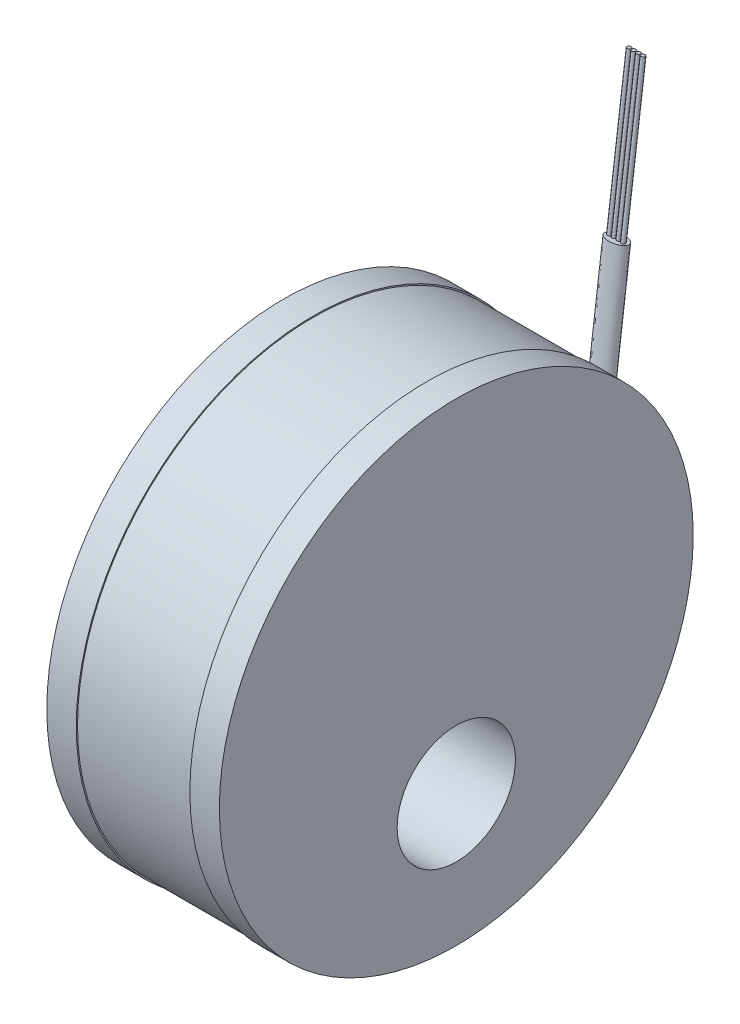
ISO-10303-21;
HEADER;
FILE_DESCRIPTION(('STEP AP214'),'2;1');
FILE_NAME('part.step','',(''),(''),'','','');
FILE_SCHEMA(('AUTOMOTIVE_DESIGN { 1 0 10303 214 1 1 1 1 }'));
ENDSEC;
DATA;
#1=APPLICATION_CONTEXT('core data for automotive mechanical design processes');
#2=APPLICATION_PROTOCOL_DEFINITION('international standard','automotive_design',2000,#1);
#3=PRODUCT_CONTEXT('',#1,'mechanical');
#4=PRODUCT('Part','Part','',(#3));
#5=PRODUCT_RELATED_PRODUCT_CATEGORY('part','',(#4));
#6=PRODUCT_DEFINITION_FORMATION('','',#4);
#7=PRODUCT_DEFINITION_CONTEXT('part definition',#1,'design');
#8=PRODUCT_DEFINITION('design','',#6,#7);
#9=PRODUCT_DEFINITION_SHAPE('','',#8);
#10=(LENGTH_UNIT() NAMED_UNIT(*) SI_UNIT(.MILLI.,.METRE.));
#11=(NAMED_UNIT(*) PLANE_ANGLE_UNIT() SI_UNIT($,.RADIAN.));
#12=(NAMED_UNIT(*) SI_UNIT($,.STERADIAN.) SOLID_ANGLE_UNIT());
#13=UNCERTAINTY_MEASURE_WITH_UNIT(LENGTH_MEASURE(1.E-05),#10,'distance_accuracy_value','');
#14=(GEOMETRIC_REPRESENTATION_CONTEXT(3) GLOBAL_UNCERTAINTY_ASSIGNED_CONTEXT((#13)) GLOBAL_UNIT_ASSIGNED_CONTEXT((#10,
#11,#12)) REPRESENTATION_CONTEXT('',''));
#15=CARTESIAN_POINT('',(0.,0.,0.));
#16=DIRECTION('',(0.,0.,1.));
#17=DIRECTION('',(1.,0.,0.));
#18=AXIS2_PLACEMENT_3D('',#15,#16,#17);
#19=CARTESIAN_POINT('',(6.15822690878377,9.11208167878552,10.3278446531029));
#20=DIRECTION('',(-1.,0.,0.));
#21=DIRECTION('',(0.,0.,1.));
#22=AXIS2_PLACEMENT_3D('',#19,#20,#21);
#23=CYLINDRICAL_SURFACE('',#22,7.112);
#24=CARTESIAN_POINT('',(6.15822690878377,9.11208167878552,10.3278446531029));
#25=DIRECTION('',(-1.,0.,0.));
#26=DIRECTION('',(0.,0.,1.));
#27=AXIS2_PLACEMENT_3D('',#24,#25,#26);
#28=CIRCLE('',#27,7.112);
#29=CARTESIAN_POINT('',(6.15822690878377,9.11208167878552,17.4398446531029));
#30=VERTEX_POINT('',#29);
#31=EDGE_CURVE('E29',#30,#30,#28,.T.);
#32=ORIENTED_EDGE('',*,*,#31,.T.);
#33=EDGE_LOOP('',(#32));
#34=FACE_BOUND('',#33,.T.);
#35=CARTESIAN_POINT('',(2.72922690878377,9.11208167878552,10.3278446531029));
#36=DIRECTION('',(1.,0.,0.));
#37=DIRECTION('',(0.,0.,-1.));
#38=AXIS2_PLACEMENT_3D('',#35,#36,#37);
#39=CIRCLE('',#38,7.112);
#40=CARTESIAN_POINT('',(2.72922690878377,9.11208167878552,3.21584465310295));
#41=VERTEX_POINT('',#40);
#42=EDGE_CURVE('E9',#41,#41,#39,.T.);
#43=ORIENTED_EDGE('',*,*,#42,.T.);
#44=EDGE_LOOP('',(#43));
#45=FACE_BOUND('',#44,.T.);
#46=CARTESIAN_POINT('',(4.84762886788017,11.0341204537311,3.48048669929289));
#47=CARTESIAN_POINT('',(4.84845235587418,11.0574365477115,3.48703143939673));
#48=CARTESIAN_POINT('',(4.84826423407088,11.0807510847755,3.49370459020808));
#49=CARTESIAN_POINT('',(4.84589293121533,11.1272330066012,3.50726581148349));
#50=CARTESIAN_POINT('',(4.84370832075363,11.1504002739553,3.51415403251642));
#51=CARTESIAN_POINT('',(4.83729768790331,11.1963624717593,3.52807317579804));
#52=CARTESIAN_POINT('',(4.83307594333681,11.2191580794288,3.53510376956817));
#53=CARTESIAN_POINT('',(4.82225388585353,11.2641390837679,3.54922026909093));
#54=CARTESIAN_POINT('',(4.81565617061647,11.2863251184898,3.55630610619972));
#55=CARTESIAN_POINT('',(4.79918182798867,11.3317241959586,3.57104457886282));
#56=CARTESIAN_POINT('',(4.78906760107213,11.3548556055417,3.57869217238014));
#57=CARTESIAN_POINT('',(4.77136796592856,11.388287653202,3.58992435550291));
#58=CARTESIAN_POINT('',(4.76504432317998,11.3992240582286,3.59362967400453));
#59=CARTESIAN_POINT('',(4.75151691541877,11.4205832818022,3.60092177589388));
#60=CARTESIAN_POINT('',(4.74431319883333,11.4310061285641,3.60450856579));
#61=CARTESIAN_POINT('',(4.73032645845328,11.4495514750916,3.61093625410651));
#62=CARTESIAN_POINT('',(4.7236764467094,11.4577660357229,3.6138011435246));
#63=CARTESIAN_POINT('',(4.7097851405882,11.4737235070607,3.61939747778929));
#64=CARTESIAN_POINT('',(4.70254384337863,11.4814664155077,3.6221289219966));
#65=CARTESIAN_POINT('',(4.6798900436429,11.5037888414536,3.63004443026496));
#66=CARTESIAN_POINT('',(4.66350453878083,11.5175212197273,3.63497025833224));
#67=CARTESIAN_POINT('',(4.63217574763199,11.5389643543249,3.6427204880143));
#68=CARTESIAN_POINT('',(4.61773921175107,11.5473347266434,3.64576830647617));
#69=CARTESIAN_POINT('',(4.58753137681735,11.5616725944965,3.65101103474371));
#70=CARTESIAN_POINT('',(4.57175880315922,11.5676377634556,3.65320511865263));
#71=CARTESIAN_POINT('',(4.54742948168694,11.5745790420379,3.65576426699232));
#72=CARTESIAN_POINT('',(4.53918455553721,11.5765610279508,3.65649630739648));
#73=CARTESIAN_POINT('',(4.52254330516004,11.579849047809,3.65771188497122));
#74=CARTESIAN_POINT('',(4.51414697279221,11.581155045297,3.65819540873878));
#75=CARTESIAN_POINT('',(4.488838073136,11.5839423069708,3.65922753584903));
#76=CARTESIAN_POINT('',(4.47176039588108,11.5843061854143,3.65936263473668));
#77=CARTESIAN_POINT('',(4.43956640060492,11.5818316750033,3.65844587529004));
#78=CARTESIAN_POINT('',(4.42442234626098,11.5793046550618,3.65750942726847));
#79=CARTESIAN_POINT('',(4.39492887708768,11.5715827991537,3.65465839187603));
#80=CARTESIAN_POINT('',(4.38057929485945,11.5663885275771,3.65274401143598));
#81=CARTESIAN_POINT('',(4.35461914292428,11.5543559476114,3.64833298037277));
#82=CARTESIAN_POINT('',(4.34288028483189,11.54775692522,3.64592195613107));
#83=CARTESIAN_POINT('',(4.32051238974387,11.5330642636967,3.64058447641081));
#84=CARTESIAN_POINT('',(4.30988391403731,11.5249698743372,3.63765776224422));
#85=CARTESIAN_POINT('',(4.28812509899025,11.5060573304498,3.630864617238));
#86=CARTESIAN_POINT('',(4.27721705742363,11.4950100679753,3.62692302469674));
#87=CARTESIAN_POINT('',(4.25717240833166,11.4715649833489,3.61863178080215));
#88=CARTESIAN_POINT('',(4.24803622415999,11.4591668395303,3.6142820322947));
#89=CARTESIAN_POINT('',(4.22620576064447,11.4253496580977,3.60253250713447));
#90=CARTESIAN_POINT('',(4.21485480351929,11.4031341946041,3.59492507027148));
#91=CARTESIAN_POINT('',(4.19600576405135,11.3571700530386,3.57945859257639));
#92=CARTESIAN_POINT('',(4.18852295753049,11.3334157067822,3.57159868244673));
#93=CARTESIAN_POINT('',(4.17792742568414,11.2905125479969,3.55766185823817));
#94=CARTESIAN_POINT('',(4.17421417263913,11.27150725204,3.55157511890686));
#95=CARTESIAN_POINT('',(4.16849242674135,11.2332516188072,3.53950294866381));
#96=CARTESIAN_POINT('',(4.16648053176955,11.2140018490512,3.53351733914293));
#97=CARTESIAN_POINT('',(4.16408213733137,11.1753106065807,3.52166796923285));
#98=CARTESIAN_POINT('',(4.16370008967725,11.1558687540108,3.51580458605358));
#99=CARTESIAN_POINT('',(4.16438679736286,11.1169498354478,3.50424880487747));
#100=CARTESIAN_POINT('',(4.16545663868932,11.0974727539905,3.49855653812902));
#101=CARTESIAN_POINT('',(4.1694202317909,11.0524327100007,3.48560156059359));
#102=CARTESIAN_POINT('',(4.17278324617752,11.0268900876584,3.47841053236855));
#103=CARTESIAN_POINT('',(4.18162699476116,10.9760643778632,3.46440475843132));
#104=CARTESIAN_POINT('',(4.18710808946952,10.950781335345,3.45759007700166));
#105=CARTESIAN_POINT('',(4.20027510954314,10.9007371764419,3.4443917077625));
#106=CARTESIAN_POINT('',(4.20795661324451,10.8759751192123,3.43800718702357));
#107=CARTESIAN_POINT('',(4.22548607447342,10.8271291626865,3.42568639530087));
#108=CARTESIAN_POINT('',(4.23533242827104,10.803044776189,3.41974979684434));
#109=CARTESIAN_POINT('',(4.25715274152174,10.7564636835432,3.40851569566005));
#110=CARTESIAN_POINT('',(4.26906778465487,10.7339424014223,3.40320598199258));
#111=CARTESIAN_POINT('',(4.29523209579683,10.6901393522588,3.39309306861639));
#112=CARTESIAN_POINT('',(4.3094817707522,10.6688578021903,3.38828995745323));
#113=CARTESIAN_POINT('',(4.33727345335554,10.6331394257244,3.38038608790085));
#114=CARTESIAN_POINT('',(4.35020452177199,10.6182642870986,3.3771496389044));
#115=CARTESIAN_POINT('',(4.37817034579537,10.5905298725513,3.37119790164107));
#116=CARTESIAN_POINT('',(4.39319793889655,10.5776640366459,3.36848091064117));
#117=CARTESIAN_POINT('',(4.41987805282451,10.5590671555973,3.36459585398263));
#118=CARTESIAN_POINT('',(4.43085519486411,10.5524191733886,3.36321928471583));
#119=CARTESIAN_POINT('',(4.45374521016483,10.540866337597,3.36084003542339));
#120=CARTESIAN_POINT('',(4.46565776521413,10.5359608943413,3.35983722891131));
#121=CARTESIAN_POINT('',(4.48804172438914,10.5289256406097,3.35840366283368));
#122=CARTESIAN_POINT('',(4.49840284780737,10.526461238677,3.35790369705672));
#123=CARTESIAN_POINT('',(4.51939413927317,10.5232470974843,3.35725220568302));
#124=CARTESIAN_POINT('',(4.53002378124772,10.5224942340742,3.3571000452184));
#125=CARTESIAN_POINT('',(4.55131539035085,10.5229161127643,3.35718540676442));
#126=CARTESIAN_POINT('',(4.5619771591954,10.5241026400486,3.35742531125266));
#127=CARTESIAN_POINT('',(4.58289005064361,10.5283881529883,3.35829484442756));
#128=CARTESIAN_POINT('',(4.59314099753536,10.5314879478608,3.35892463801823));
#129=CARTESIAN_POINT('',(4.61449325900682,10.5399435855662,3.3606518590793));
#130=CARTESIAN_POINT('',(4.62547878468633,10.5455753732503,3.36180679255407));
#131=CARTESIAN_POINT('',(4.646399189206,10.5584951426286,3.36447797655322));
#132=CARTESIAN_POINT('',(4.65633041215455,10.5657886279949,3.36599542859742));
#133=CARTESIAN_POINT('',(4.67341692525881,10.5800863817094,3.36899780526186));
#134=CARTESIAN_POINT('',(4.68074669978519,10.586896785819,3.37043730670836));
#135=CARTESIAN_POINT('',(4.6947806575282,10.6010806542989,3.3734590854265));
#136=CARTESIAN_POINT('',(4.70148575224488,10.6084532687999,3.37504114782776));
#137=CARTESIAN_POINT('',(4.71432950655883,10.6236782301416,3.37833526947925));
#138=CARTESIAN_POINT('',(4.72046675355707,10.6315316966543,3.38004763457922));
#139=CARTESIAN_POINT('',(4.73218084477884,10.6476234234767,3.38358634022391));
#140=CARTESIAN_POINT('',(4.73775747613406,10.6558618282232,3.38541272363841));
#141=CARTESIAN_POINT('',(4.75219737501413,10.6786448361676,3.39050792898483));
#142=CARTESIAN_POINT('',(4.76055944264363,10.6934864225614,3.39387434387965));
#143=CARTESIAN_POINT('',(4.77594282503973,10.7237926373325,3.4008558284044));
#144=CARTESIAN_POINT('',(4.7829632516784,10.7392576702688,3.40447106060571));
#145=CARTESIAN_POINT('',(4.79582785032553,10.7706332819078,3.4119202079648));
#146=CARTESIAN_POINT('',(4.80167098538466,10.7865442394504,3.41575431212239));
#147=CARTESIAN_POINT('',(4.81220151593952,10.8186865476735,3.42362003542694));
#148=CARTESIAN_POINT('',(4.81688921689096,10.8349178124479,3.42765160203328));
#149=CARTESIAN_POINT('',(4.82878670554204,10.8812614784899,3.43933948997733));
#150=CARTESIAN_POINT('',(4.83482499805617,10.9116252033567,3.44720626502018));
#151=CARTESIAN_POINT('',(4.84370489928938,10.9727001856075,3.46346976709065));
#152=CARTESIAN_POINT('',(4.84654428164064,11.0034116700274,3.47186685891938));
#153=CARTESIAN_POINT('',(4.84762886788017,11.0341204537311,3.48048669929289));
#154=B_SPLINE_CURVE_WITH_KNOTS('',3,(#46,#47,#48,#49,#50,#51,#52,#53,#54,#55,#56,#57,#58,#59,
#60,#61,#62,#63,#64,#65,#66,#67,#68,#69,#70,#71,#72,#73,#74,#75,#76,#77,#78,#79,#80,#81,#82,#83,
#84,#85,#86,#87,#88,#89,#90,#91,#92,#93,#94,#95,#96,#97,#98,#99,#100,#101,#102,#103,#104,#105,
#106,#107,#108,#109,#110,#111,#112,#113,#114,#115,#116,#117,#118,#119,#120,#121,#122,#123,#124,
#125,#126,#127,#128,#129,#130,#131,#132,#133,#134,#135,#136,#137,#138,#139,#140,#141,#142,#143,
#144,#145,#146,#147,#148,#149,#150,#151,#152,#153),.UNSPECIFIED.,.T.,.F.,(4,2,2,2,2,2,2,2,2,2,2,
2,2,2,2,2,2,2,2,2,2,2,2,2,2,2,2,2,2,2,2,2,2,2,2,2,2,2,2,2,2,2,2,2,2,2,2,2,2,2,2,2,2,4),(0.,
0.0726706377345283,0.145393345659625,0.217964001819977,0.290455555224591,0.369331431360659,
0.408794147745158,0.448254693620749,0.481078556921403,0.513902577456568,0.579324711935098,
0.630007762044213,0.68073972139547,0.706245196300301,0.731752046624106,0.782625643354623,
0.828496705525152,0.874358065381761,0.915247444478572,0.956157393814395,1.00402796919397,
1.05190996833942,1.1297079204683,1.20781080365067,1.2686376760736,1.32934262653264,
1.39021328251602,1.45112949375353,1.53128127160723,1.6114466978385,1.69145215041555,
1.77139853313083,1.84935931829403,1.92733370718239,1.98711084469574,2.04668854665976,
2.08528311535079,2.1238646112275,2.15572755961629,2.18753230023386,2.21953102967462,
2.25154330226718,2.28853554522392,2.32565213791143,2.35593692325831,2.38617680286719,
2.41648999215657,2.44681464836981,2.49882293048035,2.55086552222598,2.6029537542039,
2.65502820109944,2.75067354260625,2.84638541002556),.UNSPECIFIED.);
#155=CARTESIAN_POINT('',(4.84762886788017,11.0341204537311,3.48048669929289));
#156=VERTEX_POINT('',#155);
#157=EDGE_CURVE('E18',#156,#156,#154,.T.);
#158=ORIENTED_EDGE('',*,*,#157,.T.);
#159=EDGE_LOOP('',(#158));
#160=FACE_BOUND('',#159,.T.);
#161=ADVANCED_FACE('F14',(#34,#45,#160),#23,.T.);
#162=CARTESIAN_POINT('',(1.84022690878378,9.11208167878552,10.3278446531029));
#163=DIRECTION('',(-1.,0.,0.));
#164=DIRECTION('',(0.,0.,1.));
#165=AXIS2_PLACEMENT_3D('',#162,#163,#164);
#166=PLANE('',#165);
#167=CARTESIAN_POINT('',(1.84022690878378,5.93708167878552,10.3278446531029));
#168=DIRECTION('',(-1.,0.,0.));
#169=DIRECTION('',(0.,0.,1.));
#170=AXIS2_PLACEMENT_3D('',#167,#168,#169);
#171=CIRCLE('',#170,1.78434999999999);
#172=CARTESIAN_POINT('',(1.84022690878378,5.93708167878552,12.1121946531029));
#173=VERTEX_POINT('',#172);
#174=EDGE_CURVE('E112',#173,#173,#171,.T.);
#175=ORIENTED_EDGE('',*,*,#174,.F.);
#176=EDGE_LOOP('',(#175));
#177=FACE_BOUND('',#176,.T.);
#178=CARTESIAN_POINT('',(1.84022690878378,9.11208167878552,10.3278446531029));
#179=DIRECTION('',(1.,0.,0.));
#180=DIRECTION('',(0.,0.,-1.));
#181=AXIS2_PLACEMENT_3D('',#178,#179,#180);
#182=CIRCLE('',#181,7.1501);
#183=CARTESIAN_POINT('',(1.84022690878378,9.11208167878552,3.17774465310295));
#184=VERTEX_POINT('',#183);
#185=EDGE_CURVE('E91',#184,#184,#182,.T.);
#186=ORIENTED_EDGE('',*,*,#185,.F.);
#187=EDGE_LOOP('',(#186));
#188=FACE_BOUND('',#187,.T.);
#189=ADVANCED_FACE('F16',(#177,#188),#166,.T.);
#190=CARTESIAN_POINT('',(30.5021818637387,9.11208167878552,10.3278446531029));
#191=DIRECTION('',(1.,0.,0.));
#192=DIRECTION('',(0.,0.,-1.));
#193=AXIS2_PLACEMENT_3D('',#190,#191,#192);
#194=CYLINDRICAL_SURFACE('',#193,7.1501);
#195=ORIENTED_EDGE('',*,*,#185,.T.);
#196=EDGE_LOOP('',(#195));
#197=FACE_BOUND('',#196,.T.);
#198=CARTESIAN_POINT('',(2.72922690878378,9.11208167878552,10.3278446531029));
#199=DIRECTION('',(1.,0.,0.));
#200=DIRECTION('',(0.,0.,-1.));
#201=AXIS2_PLACEMENT_3D('',#198,#199,#200);
#202=CIRCLE('',#201,7.1501);
#203=CARTESIAN_POINT('',(2.72922690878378,9.11208167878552,3.17774465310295));
#204=VERTEX_POINT('',#203);
#205=EDGE_CURVE('E87',#204,#204,#202,.T.);
#206=ORIENTED_EDGE('',*,*,#205,.F.);
#207=EDGE_LOOP('',(#206));
#208=FACE_BOUND('',#207,.T.);
#209=ADVANCED_FACE('F182',(#197,#208),#194,.T.);
#210=CARTESIAN_POINT('',(2.72922690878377,9.11208167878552,3.17774465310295));
#211=DIRECTION('',(1.,0.,0.));
#212=DIRECTION('',(0.,0.,-1.));
#213=AXIS2_PLACEMENT_3D('',#210,#211,#212);
#214=PLANE('',#213);
#215=ORIENTED_EDGE('',*,*,#42,.F.);
#216=EDGE_LOOP('',(#215));
#217=FACE_BOUND('',#216,.T.);
#218=ORIENTED_EDGE('',*,*,#205,.T.);
#219=EDGE_LOOP('',(#218));
#220=FACE_BOUND('',#219,.T.);
#221=ADVANCED_FACE('F172',(#217,#220),#214,.T.);
#222=CARTESIAN_POINT('',(7.04722690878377,9.11208167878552,3.17774465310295));
#223=DIRECTION('',(1.,0.,0.));
#224=DIRECTION('',(0.,0.,-1.));
#225=AXIS2_PLACEMENT_3D('',#222,#223,#224);
#226=PLANE('',#225);
#227=CARTESIAN_POINT('',(7.04722690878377,5.93708167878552,10.3278446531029));
#228=DIRECTION('',(-1.,0.,0.));
#229=DIRECTION('',(0.,0.,1.));
#230=AXIS2_PLACEMENT_3D('',#227,#228,#229);
#231=CIRCLE('',#230,1.78435);
#232=CARTESIAN_POINT('',(7.04722690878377,5.93708167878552,12.1121946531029));
#233=VERTEX_POINT('',#232);
#234=EDGE_CURVE('E120',#233,#233,#231,.T.);
#235=ORIENTED_EDGE('',*,*,#234,.T.);
#236=EDGE_LOOP('',(#235));
#237=FACE_BOUND('',#236,.T.);
#238=CARTESIAN_POINT('',(7.04722690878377,9.11208167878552,10.3278446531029));
#239=DIRECTION('',(1.,0.,0.));
#240=DIRECTION('',(0.,0.,-1.));
#241=AXIS2_PLACEMENT_3D('',#238,#239,#240);
#242=CIRCLE('',#241,7.1501);
#243=CARTESIAN_POINT('',(7.04722690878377,9.11208167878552,3.17774465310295));
#244=VERTEX_POINT('',#243);
#245=EDGE_CURVE('E79',#244,#244,#242,.T.);
#246=ORIENTED_EDGE('',*,*,#245,.T.);
#247=EDGE_LOOP('',(#246));
#248=FACE_BOUND('',#247,.T.);
#249=ADVANCED_FACE('F168',(#237,#248),#226,.T.);
#250=CARTESIAN_POINT('',(30.5021818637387,9.11208167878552,10.3278446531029));
#251=DIRECTION('',(1.,0.,0.));
#252=DIRECTION('',(0.,0.,-1.));
#253=AXIS2_PLACEMENT_3D('',#250,#251,#252);
#254=CYLINDRICAL_SURFACE('',#253,7.1501);
#255=CARTESIAN_POINT('',(6.15822690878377,9.11208167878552,10.3278446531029));
#256=DIRECTION('',(1.,0.,0.));
#257=DIRECTION('',(0.,0.,-1.));
#258=AXIS2_PLACEMENT_3D('',#255,#256,#257);
#259=CIRCLE('',#258,7.1501);
#260=CARTESIAN_POINT('',(6.15822690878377,9.11208167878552,3.17774465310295));
#261=VERTEX_POINT('',#260);
#262=EDGE_CURVE('E83',#261,#261,#259,.T.);
#263=ORIENTED_EDGE('',*,*,#262,.T.);
#264=EDGE_LOOP('',(#263));
#265=FACE_BOUND('',#264,.T.);
#266=ORIENTED_EDGE('',*,*,#245,.F.);
#267=EDGE_LOOP('',(#266));
#268=FACE_BOUND('',#267,.T.);
#269=ADVANCED_FACE('F171',(#265,#268),#254,.T.);
#270=CARTESIAN_POINT('',(6.15822690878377,9.11208167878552,4.37154465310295));
#271=DIRECTION('',(-1.,0.,0.));
#272=DIRECTION('',(0.,0.,1.));
#273=AXIS2_PLACEMENT_3D('',#270,#271,#272);
#274=PLANE('',#273);
#275=ORIENTED_EDGE('',*,*,#31,.F.);
#276=EDGE_LOOP('',(#275));
#277=FACE_BOUND('',#276,.T.);
#278=ORIENTED_EDGE('',*,*,#262,.F.);
#279=EDGE_LOOP('',(#278));
#280=FACE_BOUND('',#279,.T.);
#281=ADVANCED_FACE('F176',(#277,#280),#274,.T.);
#282=CARTESIAN_POINT('',(4.1640368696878,15.4791950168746,2.97052768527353));
#283=DIRECTION('',(8.73464607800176E-05,-0.991875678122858,0.127210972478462));
#284=DIRECTION('',(-0.087133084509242,-0.126734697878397,-0.988102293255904));
#285=AXIS2_PLACEMENT_3D('',#282,#283,#284);
#286=PLANE('',#285);
#287=CARTESIAN_POINT('',(4.56421566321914,15.4756562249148,2.94266062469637));
#288=DIRECTION('',(8.73464607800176E-05,-0.991875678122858,0.127210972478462));
#289=DIRECTION('',(0.0569559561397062,-0.126999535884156,-0.990266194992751));
#290=AXIS2_PLACEMENT_3D('',#287,#288,#289);
#291=ELLIPSE('',#290,0.0635000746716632,0.0635000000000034);
#292=CARTESIAN_POINT('',(4.56783237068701,15.4675917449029,2.87977864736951));
#293=VERTEX_POINT('',#292);
#294=EDGE_CURVE('E72',#293,#293,#291,.F.);
#295=ORIENTED_EDGE('',*,*,#294,.F.);
#296=EDGE_LOOP('',(#295));
#297=FACE_BOUND('',#296,.T.);
#298=CARTESIAN_POINT('',(4.28481566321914,15.4756320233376,2.9426637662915));
#299=DIRECTION('',(8.73464607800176E-05,-0.991875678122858,0.127210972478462));
#300=DIRECTION('',(0.0569559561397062,-0.126999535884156,-0.990266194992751));
#301=AXIS2_PLACEMENT_3D('',#298,#299,#300);
#302=ELLIPSE('',#301,0.0635000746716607,0.0635000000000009);
#303=CARTESIAN_POINT('',(4.28843237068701,15.4675675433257,2.87978178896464));
#304=VERTEX_POINT('',#303);
#305=EDGE_CURVE('E108',#304,#304,#302,.F.);
#306=ORIENTED_EDGE('',*,*,#305,.F.);
#307=EDGE_LOOP('',(#306));
#308=FACE_BOUND('',#307,.T.);
#309=CARTESIAN_POINT('',(4.70391566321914,15.4756683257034,2.94265905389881));
#310=DIRECTION('',(8.73464607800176E-05,-0.991875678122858,0.127210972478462));
#311=DIRECTION('',(0.0569559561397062,-0.126999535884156,-0.990266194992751));
#312=AXIS2_PLACEMENT_3D('',#309,#310,#311);
#313=ELLIPSE('',#312,0.0635000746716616,0.0635000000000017);
#314=CARTESIAN_POINT('',(4.70753237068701,15.4676038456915,2.87977707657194));
#315=VERTEX_POINT('',#314);
#316=EDGE_CURVE('E100',#315,#315,#313,.F.);
#317=ORIENTED_EDGE('',*,*,#316,.F.);
#318=EDGE_LOOP('',(#317));
#319=FACE_BOUND('',#318,.T.);
#320=CARTESIAN_POINT('',(4.42451566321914,15.4756441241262,2.94266219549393));
#321=DIRECTION('',(8.73464607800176E-05,-0.991875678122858,0.127210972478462));
#322=DIRECTION('',(0.0569559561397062,-0.126999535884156,-0.990266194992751));
#323=AXIS2_PLACEMENT_3D('',#320,#321,#322);
#324=ELLIPSE('',#323,0.0635000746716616,0.0635000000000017);
#325=CARTESIAN_POINT('',(4.42813237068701,15.4675796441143,2.87978021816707));
#326=VERTEX_POINT('',#325);
#327=EDGE_CURVE('E97',#326,#326,#324,.F.);
#328=ORIENTED_EDGE('',*,*,#327,.F.);
#329=EDGE_LOOP('',(#328));
#330=FACE_BOUND('',#329,.T.);
#331=CARTESIAN_POINT('',(4.84723808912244,15.4716665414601,2.91135836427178));
#332=CARTESIAN_POINT('',(4.84395535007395,15.4668918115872,2.87413160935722));
#333=CARTESIAN_POINT('',(4.82476633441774,15.4624957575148,2.83986834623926));
#334=CARTESIAN_POINT('',(4.77216583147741,15.4558161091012,2.78782262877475));
#335=CARTESIAN_POINT('',(4.73918924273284,15.4533896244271,2.76892574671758));
#336=CARTESIAN_POINT('',(4.63618058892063,15.4481950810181,2.72849414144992));
#337=CARTESIAN_POINT('',(4.5608870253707,15.4472560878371,2.72122442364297));
#338=CARTESIAN_POINT('',(4.4125345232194,15.448898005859,2.73412847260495));
#339=CARTESIAN_POINT('',(4.33985463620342,15.4514625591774,2.75417443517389));
#340=CARTESIAN_POINT('',(4.24527262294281,15.4588626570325,2.81193862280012));
#341=CARTESIAN_POINT('',(4.21621517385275,15.4619661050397,2.83615644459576));
#342=CARTESIAN_POINT('',(4.17346660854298,15.4697315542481,2.89673372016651));
#343=CARTESIAN_POINT('',(4.16081935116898,15.474472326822,2.93370664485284));
#344=CARTESIAN_POINT('',(4.16725438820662,15.4839177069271,3.00734872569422));
#345=CARTESIAN_POINT('',(4.1862643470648,15.4883437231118,3.04184572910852));
#346=CARTESIAN_POINT('',(4.23920798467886,15.4950745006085,3.094289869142));
#347=CARTESIAN_POINT('',(4.27205938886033,15.4974839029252,3.11305364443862));
#348=CARTESIAN_POINT('',(4.37514389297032,15.5026827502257,3.15351875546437));
#349=CARTESIAN_POINT('',(4.4507479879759,15.5036105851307,3.16070125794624));
#350=CARTESIAN_POINT('',(4.59782114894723,15.5019926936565,3.14798542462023));
#351=CARTESIAN_POINT('',(4.67014238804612,15.4994928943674,3.12844460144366));
#352=CARTESIAN_POINT('',(4.76580264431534,15.4920394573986,3.07026378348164));
#353=CARTESIAN_POINT('',(4.79491694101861,15.488922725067,3.04594234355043));
#354=CARTESIAN_POINT('',(4.83755831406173,15.4812053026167,2.98573961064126));
#355=CARTESIAN_POINT('',(4.85052082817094,15.476441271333,2.94858511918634));
#356=CARTESIAN_POINT('',(4.84723808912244,15.4716665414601,2.91135836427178));
#357=B_SPLINE_CURVE_WITH_KNOTS('',3,(#331,#332,#333,#334,#335,#336,#337,#338,#339,#340,#341,
#342,#343,#344,#345,#346,#347,#348,#349,#350,#351,#352,#353,#354,#355,#356),.UNSPECIFIED.,.T.,
.F.,(4,2,2,2,2,2,2,2,2,2,2,2,4),(0.,0.0625,0.125,0.25,0.375,0.4375,0.5,0.5625,0.625,0.75,0.875,
0.9375,1.),.UNSPECIFIED.);
#358=CARTESIAN_POINT('',(4.84723808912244,15.4716665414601,2.91135836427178));
#359=VERTEX_POINT('',#358);
#360=EDGE_CURVE('E101',#359,#359,#357,.T.);
#361=ORIENTED_EDGE('',*,*,#360,.T.);
#362=EDGE_LOOP('',(#361));
#363=FACE_BOUND('',#362,.T.);
#364=ADVANCED_FACE('F135',(#297,#308,#319,#330,#363),#286,.F.);
#365=DIRECTION('',(8.73464607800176E-05,-0.991875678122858,0.127210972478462));
#366=VECTOR('',#365,1.);
#367=SURFACE_OF_LINEAR_EXTRUSION('',#357,#366);
#368=ORIENTED_EDGE('',*,*,#157,.F.);
#369=EDGE_LOOP('',(#368));
#370=FACE_BOUND('',#369,.T.);
#371=ORIENTED_EDGE('',*,*,#360,.F.);
#372=EDGE_LOOP('',(#371));
#373=FACE_BOUND('',#372,.T.);
#374=ADVANCED_FACE('F129',(#370,#373),#367,.F.);
#375=CARTESIAN_POINT('',(4.70391566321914,20.0647183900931,2.34695666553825));
#376=DIRECTION('',(0.,0.991679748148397,-0.128729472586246));
#377=DIRECTION('',(0.,0.128729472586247,0.991679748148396));
#378=AXIS2_PLACEMENT_3D('',#375,#376,#377);
#379=PLANE('',#378);
#380=CARTESIAN_POINT('',(4.70391566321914,20.0647183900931,2.34695666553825));
#381=DIRECTION('',(0.,0.991679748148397,-0.128729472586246));
#382=DIRECTION('',(0.,0.128729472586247,0.991679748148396));
#383=AXIS2_PLACEMENT_3D('',#380,#381,#382);
#384=CIRCLE('',#383,0.0635000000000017);
#385=CARTESIAN_POINT('',(4.70391566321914,20.0728927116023,2.40992832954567));
#386=VERTEX_POINT('',#385);
#387=EDGE_CURVE('E61',#386,#386,#384,.T.);
#388=ORIENTED_EDGE('',*,*,#387,.T.);
#389=EDGE_LOOP('',(#388));
#390=FACE_BOUND('',#389,.T.);
#391=ADVANCED_FACE('F134',(#390),#379,.T.);
#392=CARTESIAN_POINT('',(4.70391566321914,7.47038558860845,3.98182096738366));
#393=DIRECTION('',(0.,0.991679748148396,-0.128729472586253));
#394=DIRECTION('',(0.,0.128729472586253,0.991679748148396));
#395=AXIS2_PLACEMENT_3D('',#392,#393,#394);
#396=CYLINDRICAL_SURFACE('',#395,0.0635000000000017);
#397=ORIENTED_EDGE('',*,*,#387,.F.);
#398=EDGE_LOOP('',(#397));
#399=FACE_BOUND('',#398,.T.);
#400=ORIENTED_EDGE('',*,*,#316,.T.);
#401=EDGE_LOOP('',(#400));
#402=FACE_BOUND('',#401,.T.);
#403=ADVANCED_FACE('F145',(#399,#402),#396,.T.);
#404=CARTESIAN_POINT('',(4.28481566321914,20.0647183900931,2.34695666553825));
#405=DIRECTION('',(0.,0.991679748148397,-0.128729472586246));
#406=DIRECTION('',(0.,0.128729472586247,0.991679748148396));
#407=AXIS2_PLACEMENT_3D('',#404,#405,#406);
#408=PLANE('',#407);
#409=CARTESIAN_POINT('',(4.28481566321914,20.0647183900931,2.34695666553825));
#410=DIRECTION('',(0.,0.991679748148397,-0.128729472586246));
#411=DIRECTION('',(0.,0.128729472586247,0.991679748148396));
#412=AXIS2_PLACEMENT_3D('',#409,#410,#411);
#413=CIRCLE('',#412,0.0635000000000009);
#414=CARTESIAN_POINT('',(4.28481566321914,20.0728927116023,2.40992832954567));
#415=VERTEX_POINT('',#414);
#416=EDGE_CURVE('E47',#415,#415,#413,.T.);
#417=ORIENTED_EDGE('',*,*,#416,.T.);
#418=EDGE_LOOP('',(#417));
#419=FACE_BOUND('',#418,.T.);
#420=ADVANCED_FACE('F148',(#419),#408,.T.);
#421=CARTESIAN_POINT('',(4.28481566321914,7.47038558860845,3.98182096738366));
#422=DIRECTION('',(0.,0.991679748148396,-0.128729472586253));
#423=DIRECTION('',(0.,0.128729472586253,0.991679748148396));
#424=AXIS2_PLACEMENT_3D('',#421,#422,#423);
#425=CYLINDRICAL_SURFACE('',#424,0.0635000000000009);
#426=ORIENTED_EDGE('',*,*,#416,.F.);
#427=EDGE_LOOP('',(#426));
#428=FACE_BOUND('',#427,.T.);
#429=ORIENTED_EDGE('',*,*,#305,.T.);
#430=EDGE_LOOP('',(#429));
#431=FACE_BOUND('',#430,.T.);
#432=ADVANCED_FACE('F153',(#428,#431),#425,.T.);
#433=CARTESIAN_POINT('',(4.56421566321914,20.0647183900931,2.34695666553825));
#434=DIRECTION('',(0.,0.991679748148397,-0.128729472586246));
#435=DIRECTION('',(0.,0.128729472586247,0.991679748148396));
#436=AXIS2_PLACEMENT_3D('',#433,#434,#435);
#437=PLANE('',#436);
#438=CARTESIAN_POINT('',(4.56421566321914,20.0647183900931,2.34695666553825));
#439=DIRECTION('',(0.,0.991679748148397,-0.128729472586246));
#440=DIRECTION('',(0.,0.128729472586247,0.991679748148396));
#441=AXIS2_PLACEMENT_3D('',#438,#439,#440);
#442=CIRCLE('',#441,0.0635000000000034);
#443=CARTESIAN_POINT('',(4.56421566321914,20.0728927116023,2.40992832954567));
#444=VERTEX_POINT('',#443);
#445=EDGE_CURVE('E40',#444,#444,#442,.T.);
#446=ORIENTED_EDGE('',*,*,#445,.T.);
#447=EDGE_LOOP('',(#446));
#448=FACE_BOUND('',#447,.T.);
#449=ADVANCED_FACE('F156',(#448),#437,.T.);
#450=CARTESIAN_POINT('',(4.56421566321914,7.47038558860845,3.98182096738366));
#451=DIRECTION('',(0.,0.991679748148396,-0.128729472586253));
#452=DIRECTION('',(0.,0.128729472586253,0.991679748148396));
#453=AXIS2_PLACEMENT_3D('',#450,#451,#452);
#454=CYLINDRICAL_SURFACE('',#453,0.0635000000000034);
#455=ORIENTED_EDGE('',*,*,#445,.F.);
#456=EDGE_LOOP('',(#455));
#457=FACE_BOUND('',#456,.T.);
#458=ORIENTED_EDGE('',*,*,#294,.T.);
#459=EDGE_LOOP('',(#458));
#460=FACE_BOUND('',#459,.T.);
#461=ADVANCED_FACE('F144',(#457,#460),#454,.T.);
#462=CARTESIAN_POINT('',(4.42451566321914,20.0647183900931,2.34695666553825));
#463=DIRECTION('',(0.,0.991679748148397,-0.128729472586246));
#464=DIRECTION('',(0.,0.128729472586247,0.991679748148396));
#465=AXIS2_PLACEMENT_3D('',#462,#463,#464);
#466=PLANE('',#465);
#467=CARTESIAN_POINT('',(4.42451566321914,20.0647183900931,2.34695666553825));
#468=DIRECTION('',(0.,0.991679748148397,-0.128729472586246));
#469=DIRECTION('',(0.,0.128729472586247,0.991679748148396));
#470=AXIS2_PLACEMENT_3D('',#467,#468,#469);
#471=CIRCLE('',#470,0.0635000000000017);
#472=CARTESIAN_POINT('',(4.42451566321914,20.0728927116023,2.40992832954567));
#473=VERTEX_POINT('',#472);
#474=EDGE_CURVE('E57',#473,#473,#471,.T.);
#475=ORIENTED_EDGE('',*,*,#474,.T.);
#476=EDGE_LOOP('',(#475));
#477=FACE_BOUND('',#476,.T.);
#478=ADVANCED_FACE('F58',(#477),#466,.T.);
#479=CARTESIAN_POINT('',(4.42451566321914,7.47038558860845,3.98182096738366));
#480=DIRECTION('',(0.,0.991679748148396,-0.128729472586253));
#481=DIRECTION('',(0.,0.128729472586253,0.991679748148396));
#482=AXIS2_PLACEMENT_3D('',#479,#480,#481);
#483=CYLINDRICAL_SURFACE('',#482,0.0635000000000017);
#484=ORIENTED_EDGE('',*,*,#474,.F.);
#485=EDGE_LOOP('',(#484));
#486=FACE_BOUND('',#485,.T.);
#487=ORIENTED_EDGE('',*,*,#327,.T.);
#488=EDGE_LOOP('',(#487));
#489=FACE_BOUND('',#488,.T.);
#490=ADVANCED_FACE('F138',(#486,#489),#483,.T.);
#491=CARTESIAN_POINT('',(1.84022690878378,5.93708167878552,10.3278446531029));
#492=DIRECTION('',(-1.,0.,0.));
#493=DIRECTION('',(0.,0.,1.));
#494=AXIS2_PLACEMENT_3D('',#491,#492,#493);
#495=CYLINDRICAL_SURFACE('',#494,1.78434999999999);
#496=ORIENTED_EDGE('',*,*,#234,.F.);
#497=EDGE_LOOP('',(#496));
#498=FACE_BOUND('',#497,.T.);
#499=ORIENTED_EDGE('',*,*,#174,.T.);
#500=EDGE_LOOP('',(#499));
#501=FACE_BOUND('',#500,.T.);
#502=ADVANCED_FACE('F141',(#498,#501),#495,.F.);
#503=CLOSED_SHELL('',(#161,#189,#209,#221,#249,#269,#281,#364,#374,#391,#403,#420,#432,#449,
#461,#478,#490,#502));
#504=MANIFOLD_SOLID_BREP('B1',#503);
#505=ADVANCED_BREP_SHAPE_REPRESENTATION('',(#18,#504),#14);
#506=SHAPE_DEFINITION_REPRESENTATION(#9,#505);
ENDSEC;
END-ISO-10303-21;
